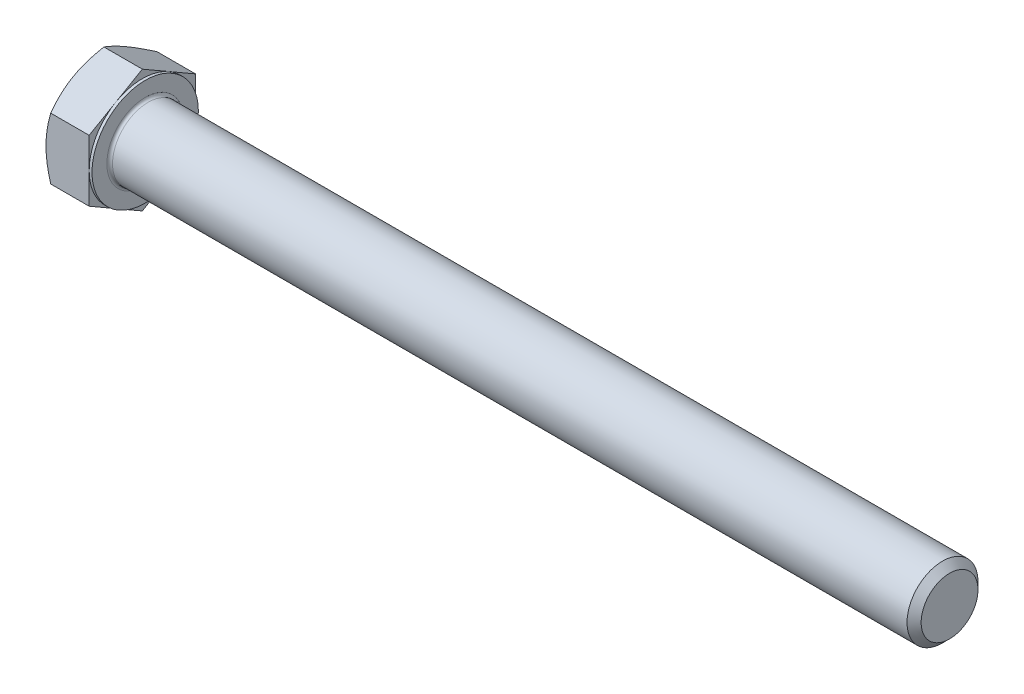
ISO-10303-21;
HEADER;
FILE_DESCRIPTION(('STEP AP214'),'2;1');
FILE_NAME('part.step','',(''),(''),'','','');
FILE_SCHEMA(('AUTOMOTIVE_DESIGN { 1 0 10303 214 1 1 1 1 }'));
ENDSEC;
DATA;
#1=APPLICATION_CONTEXT('core data for automotive mechanical design processes');
#2=APPLICATION_PROTOCOL_DEFINITION('international standard','automotive_design',2000,#1);
#3=PRODUCT_CONTEXT('',#1,'mechanical');
#4=PRODUCT('Part','Part','',(#3));
#5=PRODUCT_RELATED_PRODUCT_CATEGORY('part','',(#4));
#6=PRODUCT_DEFINITION_FORMATION('','',#4);
#7=PRODUCT_DEFINITION_CONTEXT('part definition',#1,'design');
#8=PRODUCT_DEFINITION('design','',#6,#7);
#9=PRODUCT_DEFINITION_SHAPE('','',#8);
#10=(LENGTH_UNIT() NAMED_UNIT(*) SI_UNIT(.MILLI.,.METRE.));
#11=(NAMED_UNIT(*) PLANE_ANGLE_UNIT() SI_UNIT($,.RADIAN.));
#12=(NAMED_UNIT(*) SI_UNIT($,.STERADIAN.) SOLID_ANGLE_UNIT());
#13=UNCERTAINTY_MEASURE_WITH_UNIT(LENGTH_MEASURE(1.E-05),#10,'distance_accuracy_value','');
#14=(GEOMETRIC_REPRESENTATION_CONTEXT(3) GLOBAL_UNCERTAINTY_ASSIGNED_CONTEXT((#13)) GLOBAL_UNIT_ASSIGNED_CONTEXT((#10,
#11,#12)) REPRESENTATION_CONTEXT('',''));
#15=CARTESIAN_POINT('',(0.,0.,0.));
#16=DIRECTION('',(0.,0.,1.));
#17=DIRECTION('',(1.,0.,0.));
#18=AXIS2_PLACEMENT_3D('',#15,#16,#17);
#19=CARTESIAN_POINT('',(6.5532,0.,0.));
#20=DIRECTION('',(1.,0.,0.));
#21=DIRECTION('',(0.,0.,-1.));
#22=AXIS2_PLACEMENT_3D('',#19,#20,#21);
#23=TOROIDAL_SURFACE('',#22,5.1435,0.381);
#24=CARTESIAN_POINT('',(6.5532,0.,0.));
#25=DIRECTION('',(1.,0.,0.));
#26=DIRECTION('',(0.,0.,-1.));
#27=AXIS2_PLACEMENT_3D('',#24,#25,#26);
#28=CIRCLE('',#27,4.7625);
#29=CARTESIAN_POINT('',(6.5532,0.,-4.7625));
#30=VERTEX_POINT('',#29);
#31=EDGE_CURVE('E28',#30,#30,#28,.T.);
#32=ORIENTED_EDGE('',*,*,#31,.F.);
#33=EDGE_LOOP('',(#32));
#34=FACE_BOUND('',#33,.T.);
#35=CARTESIAN_POINT('',(6.1722,0.,0.));
#36=DIRECTION('',(-1.,0.,0.));
#37=DIRECTION('',(0.,0.,-1.));
#38=AXIS2_PLACEMENT_3D('',#35,#36,#37);
#39=CIRCLE('',#38,5.1435);
#40=CARTESIAN_POINT('',(6.1722,0.,-5.1435));
#41=VERTEX_POINT('',#40);
#42=EDGE_CURVE('E236',#41,#41,#39,.T.);
#43=ORIENTED_EDGE('',*,*,#42,.F.);
#44=EDGE_LOOP('',(#43));
#45=FACE_BOUND('',#44,.T.);
#46=ADVANCED_FACE('F17',(#34,#45),#23,.F.);
#47=CARTESIAN_POINT('',(0.,0.,0.));
#48=DIRECTION('',(-1.,0.,0.));
#49=DIRECTION('',(0.,0.,1.));
#50=AXIS2_PLACEMENT_3D('',#47,#48,#49);
#51=CYLINDRICAL_SURFACE('',#50,7.1374);
#52=CARTESIAN_POINT('',(6.1722,0.,0.));
#53=DIRECTION('',(1.,0.,0.));
#54=DIRECTION('',(0.,0.,-1.));
#55=AXIS2_PLACEMENT_3D('',#52,#53,#54);
#56=CIRCLE('',#55,7.1374);
#57=CARTESIAN_POINT('',(6.1722,0.,-7.1374));
#58=VERTEX_POINT('',#57);
#59=EDGE_CURVE('E238',#58,#58,#56,.T.);
#60=ORIENTED_EDGE('',*,*,#59,.F.);
#61=EDGE_LOOP('',(#60));
#62=FACE_BOUND('',#61,.T.);
#63=CARTESIAN_POINT('',(5.7912,0.,0.));
#64=DIRECTION('',(-1.,0.,0.));
#65=DIRECTION('',(0.,0.,1.));
#66=AXIS2_PLACEMENT_3D('',#63,#64,#65);
#67=CIRCLE('',#66,7.1374);
#68=CARTESIAN_POINT('',(5.7912,0.,-7.1374));
#69=VERTEX_POINT('',#68);
#70=CARTESIAN_POINT('',(5.7912,-6.18116971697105,-3.5687));
#71=VERTEX_POINT('',#70);
#72=EDGE_CURVE('E221',#69,#71,#67,.T.);
#73=ORIENTED_EDGE('',*,*,#72,.F.);
#74=CARTESIAN_POINT('',(5.7912,0.,0.));
#75=DIRECTION('',(-1.,0.,0.));
#76=DIRECTION('',(0.,0.,1.));
#77=AXIS2_PLACEMENT_3D('',#74,#75,#76);
#78=CIRCLE('',#77,7.1374);
#79=CARTESIAN_POINT('',(5.7912,6.18116971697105,-3.5687));
#80=VERTEX_POINT('',#79);
#81=EDGE_CURVE('E233',#80,#69,#78,.T.);
#82=ORIENTED_EDGE('',*,*,#81,.F.);
#83=CARTESIAN_POINT('',(5.7912,0.,0.));
#84=DIRECTION('',(-1.,0.,0.));
#85=DIRECTION('',(0.,0.,1.));
#86=AXIS2_PLACEMENT_3D('',#83,#84,#85);
#87=CIRCLE('',#86,7.1374);
#88=CARTESIAN_POINT('',(5.7912,6.18116971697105,3.5687));
#89=VERTEX_POINT('',#88);
#90=EDGE_CURVE('E161',#89,#80,#87,.T.);
#91=ORIENTED_EDGE('',*,*,#90,.F.);
#92=CARTESIAN_POINT('',(5.7912,0.,0.));
#93=DIRECTION('',(-1.,0.,0.));
#94=DIRECTION('',(0.,0.,1.));
#95=AXIS2_PLACEMENT_3D('',#92,#93,#94);
#96=CIRCLE('',#95,7.1374);
#97=CARTESIAN_POINT('',(5.7912,0.,7.1374));
#98=VERTEX_POINT('',#97);
#99=EDGE_CURVE('E154',#98,#89,#96,.T.);
#100=ORIENTED_EDGE('',*,*,#99,.F.);
#101=CARTESIAN_POINT('',(5.7912,0.,0.));
#102=DIRECTION('',(-1.,0.,0.));
#103=DIRECTION('',(0.,0.,1.));
#104=AXIS2_PLACEMENT_3D('',#101,#102,#103);
#105=CIRCLE('',#104,7.1374);
#106=CARTESIAN_POINT('',(5.7912,-6.18116971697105,3.5687));
#107=VERTEX_POINT('',#106);
#108=EDGE_CURVE('E158',#107,#98,#105,.T.);
#109=ORIENTED_EDGE('',*,*,#108,.F.);
#110=CARTESIAN_POINT('',(5.7912,0.,0.));
#111=DIRECTION('',(-1.,0.,0.));
#112=DIRECTION('',(0.,0.,1.));
#113=AXIS2_PLACEMENT_3D('',#110,#111,#112);
#114=CIRCLE('',#113,7.1374);
#115=EDGE_CURVE('E177',#71,#107,#114,.T.);
#116=ORIENTED_EDGE('',*,*,#115,.F.);
#117=EDGE_LOOP('',(#73,#82,#91,#100,#109,#116));
#118=FACE_BOUND('',#117,.T.);
#119=ADVANCED_FACE('F157',(#62,#118),#51,.T.);
#120=CARTESIAN_POINT('',(114.1222,0.,0.));
#121=DIRECTION('',(-1.,0.,0.));
#122=DIRECTION('',(0.,0.,1.));
#123=AXIS2_PLACEMENT_3D('',#120,#121,#122);
#124=CONICAL_SURFACE('',#123,3.81635,0.785398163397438);
#125=CARTESIAN_POINT('',(114.1222,0.,0.));
#126=DIRECTION('',(-1.,0.,0.));
#127=DIRECTION('',(0.,0.,1.));
#128=AXIS2_PLACEMENT_3D('',#125,#126,#127);
#129=CIRCLE('',#128,3.81635);
#130=CARTESIAN_POINT('',(114.1222,0.,3.81635));
#131=VERTEX_POINT('',#130);
#132=EDGE_CURVE('E242',#131,#131,#129,.T.);
#133=ORIENTED_EDGE('',*,*,#132,.T.);
#134=EDGE_LOOP('',(#133));
#135=FACE_BOUND('',#134,.T.);
#136=CARTESIAN_POINT('',(113.17605,0.,0.));
#137=DIRECTION('',(-1.,0.,0.));
#138=DIRECTION('',(0.,0.,1.));
#139=AXIS2_PLACEMENT_3D('',#136,#137,#138);
#140=CIRCLE('',#139,4.7625);
#141=CARTESIAN_POINT('',(113.17605,0.,4.7625));
#142=VERTEX_POINT('',#141);
#143=EDGE_CURVE('E11',#142,#142,#140,.T.);
#144=ORIENTED_EDGE('',*,*,#143,.F.);
#145=EDGE_LOOP('',(#144));
#146=FACE_BOUND('',#145,.T.);
#147=ADVANCED_FACE('F577',(#135,#146),#124,.T.);
#148=CARTESIAN_POINT('',(0.,0.,0.));
#149=DIRECTION('',(-1.,0.,0.));
#150=DIRECTION('',(0.,0.,1.));
#151=AXIS2_PLACEMENT_3D('',#148,#149,#150);
#152=CYLINDRICAL_SURFACE('',#151,4.7625);
#153=ORIENTED_EDGE('',*,*,#143,.T.);
#154=EDGE_LOOP('',(#153));
#155=FACE_BOUND('',#154,.T.);
#156=ORIENTED_EDGE('',*,*,#31,.T.);
#157=EDGE_LOOP('',(#156));
#158=FACE_BOUND('',#157,.T.);
#159=ADVANCED_FACE('F586',(#155,#158),#152,.T.);
#160=CARTESIAN_POINT('',(6.1722,8.24155962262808,0.));
#161=DIRECTION('',(1.,0.,0.));
#162=DIRECTION('',(0.,1.,0.));
#163=AXIS2_PLACEMENT_3D('',#160,#161,#162);
#164=PLANE('',#163);
#165=ORIENTED_EDGE('',*,*,#42,.T.);
#166=EDGE_LOOP('',(#165));
#167=FACE_BOUND('',#166,.T.);
#168=ORIENTED_EDGE('',*,*,#59,.T.);
#169=EDGE_LOOP('',(#168));
#170=FACE_BOUND('',#169,.T.);
#171=ADVANCED_FACE('F582',(#167,#170),#164,.T.);
#172=CARTESIAN_POINT('',(114.1222,0.,0.));
#173=DIRECTION('',(-1.,0.,0.));
#174=DIRECTION('',(0.,0.,1.));
#175=AXIS2_PLACEMENT_3D('',#172,#173,#174);
#176=PLANE('',#175);
#177=ORIENTED_EDGE('',*,*,#132,.F.);
#178=EDGE_LOOP('',(#177));
#179=FACE_BOUND('',#178,.T.);
#180=ADVANCED_FACE('F585',(#179),#176,.F.);
#181=CARTESIAN_POINT('',(5.7912,7.1374,0.));
#182=DIRECTION('',(1.,0.,0.));
#183=DIRECTION('',(0.,1.,0.));
#184=AXIS2_PLACEMENT_3D('',#181,#182,#183);
#185=PLANE('',#184);
#186=DIRECTION('',(0.,0.5,0.866025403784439));
#187=VECTOR('',#186,1.);
#188=CARTESIAN_POINT('',(5.7912,4.12077981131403,-7.1374));
#189=LINE('',#188,#187);
#190=CARTESIAN_POINT('',(5.7912,4.12077981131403,-7.1374));
#191=VERTEX_POINT('',#190);
#192=EDGE_CURVE('E305',#191,#80,#189,.T.);
#193=ORIENTED_EDGE('',*,*,#192,.T.);
#194=ORIENTED_EDGE('',*,*,#81,.T.);
#195=DIRECTION('',(0.,1.,0.));
#196=VECTOR('',#195,1.);
#197=CARTESIAN_POINT('',(5.7912,4.12077981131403,-7.1374));
#198=LINE('',#197,#196);
#199=EDGE_CURVE('E226',#69,#191,#198,.T.);
#200=ORIENTED_EDGE('',*,*,#199,.T.);
#201=EDGE_LOOP('',(#193,#194,#200));
#202=FACE_BOUND('',#201,.T.);
#203=ADVANCED_FACE('F691',(#202),#185,.T.);
#204=CARTESIAN_POINT('',(5.7912,7.1374,0.));
#205=DIRECTION('',(1.,0.,0.));
#206=DIRECTION('',(0.,1.,0.));
#207=AXIS2_PLACEMENT_3D('',#204,#205,#206);
#208=PLANE('',#207);
#209=DIRECTION('',(0.,0.5,0.866025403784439));
#210=VECTOR('',#209,1.);
#211=CARTESIAN_POINT('',(5.7912,4.12077981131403,-7.1374));
#212=LINE('',#211,#210);
#213=CARTESIAN_POINT('',(5.7912,8.24155962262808,0.));
#214=VERTEX_POINT('',#213);
#215=EDGE_CURVE('E545',#80,#214,#212,.T.);
#216=ORIENTED_EDGE('',*,*,#215,.T.);
#217=DIRECTION('',(0.,-0.5,0.866025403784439));
#218=VECTOR('',#217,1.);
#219=CARTESIAN_POINT('',(5.7912,8.24155962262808,0.));
#220=LINE('',#219,#218);
#221=EDGE_CURVE('E595',#214,#89,#220,.T.);
#222=ORIENTED_EDGE('',*,*,#221,.T.);
#223=ORIENTED_EDGE('',*,*,#90,.T.);
#224=EDGE_LOOP('',(#216,#222,#223));
#225=FACE_BOUND('',#224,.T.);
#226=ADVANCED_FACE('F688',(#225),#208,.T.);
#227=CARTESIAN_POINT('',(5.7912,7.1374,0.));
#228=DIRECTION('',(1.,0.,0.));
#229=DIRECTION('',(0.,1.,0.));
#230=AXIS2_PLACEMENT_3D('',#227,#228,#229);
#231=PLANE('',#230);
#232=DIRECTION('',(0.,-0.5,0.866025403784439));
#233=VECTOR('',#232,1.);
#234=CARTESIAN_POINT('',(5.7912,8.24155962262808,0.));
#235=LINE('',#234,#233);
#236=CARTESIAN_POINT('',(5.7912,4.12077981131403,7.1374));
#237=VERTEX_POINT('',#236);
#238=EDGE_CURVE('E189',#89,#237,#235,.T.);
#239=ORIENTED_EDGE('',*,*,#238,.T.);
#240=DIRECTION('',(0.,-1.,0.));
#241=VECTOR('',#240,1.);
#242=CARTESIAN_POINT('',(5.7912,4.12077981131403,7.1374));
#243=LINE('',#242,#241);
#244=EDGE_CURVE('E182',#237,#98,#243,.T.);
#245=ORIENTED_EDGE('',*,*,#244,.T.);
#246=ORIENTED_EDGE('',*,*,#99,.T.);
#247=EDGE_LOOP('',(#239,#245,#246));
#248=FACE_BOUND('',#247,.T.);
#249=ADVANCED_FACE('F188',(#248),#231,.T.);
#250=CARTESIAN_POINT('',(5.7912,7.1374,0.));
#251=DIRECTION('',(1.,0.,0.));
#252=DIRECTION('',(0.,1.,0.));
#253=AXIS2_PLACEMENT_3D('',#250,#251,#252);
#254=PLANE('',#253);
#255=DIRECTION('',(0.,-1.,0.));
#256=VECTOR('',#255,1.);
#257=CARTESIAN_POINT('',(5.7912,4.12077981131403,7.1374));
#258=LINE('',#257,#256);
#259=CARTESIAN_POINT('',(5.7912,-4.12077981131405,7.1374));
#260=VERTEX_POINT('',#259);
#261=EDGE_CURVE('E173',#98,#260,#258,.T.);
#262=ORIENTED_EDGE('',*,*,#261,.T.);
#263=DIRECTION('',(0.,-0.5,-0.866025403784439));
#264=VECTOR('',#263,1.);
#265=CARTESIAN_POINT('',(5.7912,-8.2415596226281,0.));
#266=LINE('',#265,#264);
#267=EDGE_CURVE('E175',#260,#107,#266,.T.);
#268=ORIENTED_EDGE('',*,*,#267,.T.);
#269=ORIENTED_EDGE('',*,*,#108,.T.);
#270=EDGE_LOOP('',(#262,#268,#269));
#271=FACE_BOUND('',#270,.T.);
#272=ADVANCED_FACE('F172',(#271),#254,.T.);
#273=CARTESIAN_POINT('',(5.7912,7.1374,0.));
#274=DIRECTION('',(1.,0.,0.));
#275=DIRECTION('',(0.,1.,0.));
#276=AXIS2_PLACEMENT_3D('',#273,#274,#275);
#277=PLANE('',#276);
#278=DIRECTION('',(0.,-0.5,-0.866025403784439));
#279=VECTOR('',#278,1.);
#280=CARTESIAN_POINT('',(5.7912,-8.2415596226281,0.));
#281=LINE('',#280,#279);
#282=CARTESIAN_POINT('',(5.7912,-8.2415596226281,0.));
#283=VERTEX_POINT('',#282);
#284=EDGE_CURVE('E205',#107,#283,#281,.T.);
#285=ORIENTED_EDGE('',*,*,#284,.T.);
#286=DIRECTION('',(0.,0.5,-0.866025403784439));
#287=VECTOR('',#286,1.);
#288=CARTESIAN_POINT('',(5.7912,-4.12077981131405,-7.1374));
#289=LINE('',#288,#287);
#290=EDGE_CURVE('E209',#283,#71,#289,.T.);
#291=ORIENTED_EDGE('',*,*,#290,.T.);
#292=ORIENTED_EDGE('',*,*,#115,.T.);
#293=EDGE_LOOP('',(#285,#291,#292));
#294=FACE_BOUND('',#293,.T.);
#295=ADVANCED_FACE('F437',(#294),#277,.T.);
#296=CARTESIAN_POINT('',(5.7912,7.1374,0.));
#297=DIRECTION('',(1.,0.,0.));
#298=DIRECTION('',(0.,1.,0.));
#299=AXIS2_PLACEMENT_3D('',#296,#297,#298);
#300=PLANE('',#299);
#301=DIRECTION('',(0.,0.5,-0.866025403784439));
#302=VECTOR('',#301,1.);
#303=CARTESIAN_POINT('',(5.7912,-4.12077981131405,-7.1374));
#304=LINE('',#303,#302);
#305=CARTESIAN_POINT('',(5.7912,-4.12077981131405,-7.1374));
#306=VERTEX_POINT('',#305);
#307=EDGE_CURVE('E220',#71,#306,#304,.T.);
#308=ORIENTED_EDGE('',*,*,#307,.T.);
#309=DIRECTION('',(0.,1.,0.));
#310=VECTOR('',#309,1.);
#311=CARTESIAN_POINT('',(5.7912,4.12077981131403,-7.1374));
#312=LINE('',#311,#310);
#313=EDGE_CURVE('E215',#306,#69,#312,.T.);
#314=ORIENTED_EDGE('',*,*,#313,.T.);
#315=ORIENTED_EDGE('',*,*,#72,.T.);
#316=EDGE_LOOP('',(#308,#314,#315));
#317=FACE_BOUND('',#316,.T.);
#318=ADVANCED_FACE('F633',(#317),#300,.T.);
#319=CARTESIAN_POINT('',(0.,8.24155962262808,0.));
#320=DIRECTION('',(1.,0.,0.));
#321=DIRECTION('',(0.,1.,0.));
#322=AXIS2_PLACEMENT_3D('',#319,#320,#321);
#323=PLANE('',#322);
#324=CARTESIAN_POINT('',(0.,0.,0.));
#325=DIRECTION('',(1.,0.,0.));
#326=DIRECTION('',(0.,0.,-1.));
#327=AXIS2_PLACEMENT_3D('',#324,#325,#326);
#328=CIRCLE('',#327,7.1374);
#329=CARTESIAN_POINT('',(0.,0.,-7.1374));
#330=VERTEX_POINT('',#329);
#331=CARTESIAN_POINT('',(0.,6.18116971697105,-3.5687));
#332=VERTEX_POINT('',#331);
#333=EDGE_CURVE('E318',#330,#332,#328,.T.);
#334=ORIENTED_EDGE('',*,*,#333,.F.);
#335=CARTESIAN_POINT('',(0.,0.,0.));
#336=DIRECTION('',(1.,0.,0.));
#337=DIRECTION('',(0.,0.,-1.));
#338=AXIS2_PLACEMENT_3D('',#335,#336,#337);
#339=CIRCLE('',#338,7.1374);
#340=CARTESIAN_POINT('',(0.,-6.18116971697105,-3.5687));
#341=VERTEX_POINT('',#340);
#342=EDGE_CURVE('E229',#341,#330,#339,.T.);
#343=ORIENTED_EDGE('',*,*,#342,.F.);
#344=CARTESIAN_POINT('',(0.,0.,0.));
#345=DIRECTION('',(1.,0.,0.));
#346=DIRECTION('',(0.,0.,-1.));
#347=AXIS2_PLACEMENT_3D('',#344,#345,#346);
#348=CIRCLE('',#347,7.1374);
#349=CARTESIAN_POINT('',(0.,-6.18116971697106,3.5687));
#350=VERTEX_POINT('',#349);
#351=EDGE_CURVE('E321',#350,#341,#348,.T.);
#352=ORIENTED_EDGE('',*,*,#351,.F.);
#353=CARTESIAN_POINT('',(0.,0.,0.));
#354=DIRECTION('',(1.,0.,0.));
#355=DIRECTION('',(0.,0.,-1.));
#356=AXIS2_PLACEMENT_3D('',#353,#354,#355);
#357=CIRCLE('',#356,7.1374);
#358=CARTESIAN_POINT('',(0.,0.,7.1374));
#359=VERTEX_POINT('',#358);
#360=EDGE_CURVE('E379',#359,#350,#357,.T.);
#361=ORIENTED_EDGE('',*,*,#360,.F.);
#362=CARTESIAN_POINT('',(0.,0.,0.));
#363=DIRECTION('',(-1.,0.,0.));
#364=DIRECTION('',(0.,0.,1.));
#365=AXIS2_PLACEMENT_3D('',#362,#363,#364);
#366=CIRCLE('',#365,7.1374);
#367=CARTESIAN_POINT('',(0.,6.18116971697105,3.5687));
#368=VERTEX_POINT('',#367);
#369=EDGE_CURVE('E469',#359,#368,#366,.T.);
#370=ORIENTED_EDGE('',*,*,#369,.T.);
#371=CARTESIAN_POINT('',(0.,0.,0.));
#372=DIRECTION('',(1.,0.,0.));
#373=DIRECTION('',(0.,0.,-1.));
#374=AXIS2_PLACEMENT_3D('',#371,#372,#373);
#375=CIRCLE('',#374,7.1374);
#376=EDGE_CURVE('E225',#332,#368,#375,.T.);
#377=ORIENTED_EDGE('',*,*,#376,.F.);
#378=EDGE_LOOP('',(#334,#343,#352,#361,#370,#377));
#379=FACE_BOUND('',#378,.T.);
#380=ADVANCED_FACE('F666',(#379),#323,.F.);
#381=CARTESIAN_POINT('',(0.,0.,0.));
#382=DIRECTION('',(1.,0.,0.));
#383=DIRECTION('',(0.,0.,-1.));
#384=AXIS2_PLACEMENT_3D('',#381,#382,#383);
#385=CONICAL_SURFACE('',#384,7.1374,1.0471975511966);
#386=CARTESIAN_POINT('',(0.,6.18116971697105,3.56869999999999));
#387=CARTESIAN_POINT('',(-6.04948282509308E-05,6.26773818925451,3.41865084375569));
#388=CARTESIAN_POINT('',(0.00354461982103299,6.35425597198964,3.26857482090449));
#389=CARTESIAN_POINT('',(0.0179524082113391,6.52690535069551,2.96921326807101));
#390=CARTESIAN_POINT('',(0.0287310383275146,6.61303727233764,2.81992677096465));
#391=CARTESIAN_POINT('',(0.0574742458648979,6.78593479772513,2.52072446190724));
#392=CARTESIAN_POINT('',(0.0754987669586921,6.87269960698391,2.37081398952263));
#393=CARTESIAN_POINT('',(0.118606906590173,7.0474776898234,2.06878301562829));
#394=CARTESIAN_POINT('',(0.143821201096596,7.13548235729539,1.91667635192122));
#395=CARTESIAN_POINT('',(0.19926242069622,7.30684815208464,1.61991009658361));
#396=CARTESIAN_POINT('',(0.22921829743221,7.39024249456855,1.47521869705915));
#397=CARTESIAN_POINT('',(0.295004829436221,7.55771341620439,1.18475513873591));
#398=CARTESIAN_POINT('',(0.330912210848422,7.64178308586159,1.038996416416));
#399=CARTESIAN_POINT('',(0.408543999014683,7.81108886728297,0.745574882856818));
#400=CARTESIAN_POINT('',(0.450371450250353,7.89631413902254,0.597933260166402));
#401=CARTESIAN_POINT('',(0.539828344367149,8.06833085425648,0.299991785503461));
#402=CARTESIAN_POINT('',(0.587577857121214,8.1551073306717,0.149719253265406));
#403=CARTESIAN_POINT('',(0.637486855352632,8.24155962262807,0.));
#404=B_SPLINE_CURVE_WITH_KNOTS('',3,(#386,#387,#388,#389,#390,#391,#392,#393,#394,#395,#396,
#397,#398,#399,#400,#401,#402,#403),.UNSPECIFIED.,.F.,.F.,(4,2,2,2,2,2,2,2,4),(0.,
0.519648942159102,1.0375648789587,1.55985661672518,2.09232296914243,2.60123736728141,
3.1173120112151,3.64383408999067,4.18368472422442),.UNSPECIFIED.);
#405=CARTESIAN_POINT('',(0.637486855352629,8.24155962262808,0.));
#406=VERTEX_POINT('',#405);
#407=EDGE_CURVE('E524',#368,#406,#404,.T.);
#408=ORIENTED_EDGE('',*,*,#407,.T.);
#409=CARTESIAN_POINT('',(0.637486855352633,8.24155962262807,0.));
#410=CARTESIAN_POINT('',(0.587583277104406,8.15511676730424,-0.149703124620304));
#411=CARTESIAN_POINT('',(0.539839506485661,8.06835106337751,-0.299960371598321));
#412=CARTESIAN_POINT('',(0.450390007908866,7.89635008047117,-0.59788296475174));
#413=CARTESIAN_POINT('',(0.408564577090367,7.81112970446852,-0.745521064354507));
#414=CARTESIAN_POINT('',(0.330933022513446,7.64182652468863,-1.0389453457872));
#415=CARTESIAN_POINT('',(0.295024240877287,7.55775454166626,-1.18471043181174));
#416=CARTESIAN_POINT('',(0.229229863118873,7.39026838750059,-1.47519302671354));
#417=CARTESIAN_POINT('',(0.199267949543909,7.30686116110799,-1.61989721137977));
#418=CARTESIAN_POINT('',(0.143821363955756,7.13548712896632,-1.91665800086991));
#419=CARTESIAN_POINT('',(0.118606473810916,7.04748725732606,-2.06874626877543));
#420=CARTESIAN_POINT('',(0.0754977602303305,6.87271818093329,-2.37075428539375));
#421=CARTESIAN_POINT('',(0.0574736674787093,6.78595745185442,-2.52066017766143));
#422=CARTESIAN_POINT('',(0.0287306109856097,6.61306320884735,-2.81986443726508));
#423=CARTESIAN_POINT('',(0.0179521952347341,6.52693047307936,-2.96915750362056));
#424=CARTESIAN_POINT('',(0.00354432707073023,6.35427263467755,-3.26854229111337));
#425=CARTESIAN_POINT('',(-6.05748548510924E-05,6.26774719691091,-3.41863499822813));
#426=CARTESIAN_POINT('',(0.,6.18116971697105,-3.5687));
#427=B_SPLINE_CURVE_WITH_KNOTS('',3,(#409,#410,#411,#412,#413,#414,#415,#416,#417,#418,#419,
#420,#421,#422,#423,#424,#425,#426),.UNSPECIFIED.,.F.,.F.,(4,2,2,2,2,2,2,2,4),(0.,
0.539792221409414,1.06629682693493,1.58239198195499,2.09136133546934,2.62377348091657,
3.14604706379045,3.66398121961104,4.18368491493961),.UNSPECIFIED.);
#428=EDGE_CURVE('E294',#406,#332,#427,.T.);
#429=ORIENTED_EDGE('',*,*,#428,.T.);
#430=ORIENTED_EDGE('',*,*,#376,.T.);
#431=EDGE_LOOP('',(#408,#429,#430));
#432=FACE_BOUND('',#431,.T.);
#433=ADVANCED_FACE('F271',(#432),#385,.T.);
#434=CARTESIAN_POINT('',(0.,0.,0.));
#435=DIRECTION('',(1.,0.,0.));
#436=DIRECTION('',(0.,0.,-1.));
#437=AXIS2_PLACEMENT_3D('',#434,#435,#436);
#438=CONICAL_SURFACE('',#437,7.1374,1.0471975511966);
#439=CARTESIAN_POINT('',(0.,0.,7.1374));
#440=CARTESIAN_POINT('',(-6.04948282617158E-05,0.173230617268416,7.13734591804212));
#441=CARTESIAN_POINT('',(0.00354461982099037,0.346459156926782,7.13723450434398));
#442=CARTESIAN_POINT('',(0.0179524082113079,0.692038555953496,7.13707247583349));
#443=CARTESIAN_POINT('',(0.0287310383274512,0.864390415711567,7.13702165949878));
#444=CARTESIAN_POINT('',(0.0574742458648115,1.20995597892,7.13715415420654));
#445=CARTESIAN_POINT('',(0.0754987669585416,1.3831646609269,7.13733944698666));
#446=CARTESIAN_POINT('',(0.118606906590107,1.73212019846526,7.13768621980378));
#447=CARTESIAN_POINT('',(0.143821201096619,1.90785076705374,7.13784716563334));
#448=CARTESIAN_POINT('',(0.19926242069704,2.25054078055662,7.1378711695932));
#449=CARTESIAN_POINT('',(0.229218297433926,2.41754437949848,7.13774708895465));
#450=CARTESIAN_POINT('',(0.295004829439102,2.75282866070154,7.13754938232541));
#451=CARTESIAN_POINT('',(0.330912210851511,2.92109425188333,7.13747649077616));
#452=CARTESIAN_POINT('',(0.408543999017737,3.25985764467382,7.13738883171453));
#453=CARTESIAN_POINT('',(0.450371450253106,3.43033167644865,7.13737527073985));
#454=CARTESIAN_POINT('',(0.539828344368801,3.77436491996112,7.13737537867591));
#455=CARTESIAN_POINT('',(0.587577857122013,3.94789298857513,7.13738974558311));
#456=CARTESIAN_POINT('',(0.637486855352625,4.12077981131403,7.13739999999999));
#457=B_SPLINE_CURVE_WITH_KNOTS('',3,(#439,#440,#441,#442,#443,#444,#445,#446,#447,#448,#449,
#450,#451,#452,#453,#454,#455,#456),.UNSPECIFIED.,.F.,.F.,(4,2,2,2,2,2,2,2,4),(0.,
0.519648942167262,1.03756487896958,1.55985661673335,2.09232296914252,2.60123736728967,
3.11731201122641,3.64383408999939,4.18368472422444),.UNSPECIFIED.);
#458=CARTESIAN_POINT('',(0.637486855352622,4.12077981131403,7.1374));
#459=VERTEX_POINT('',#458);
#460=EDGE_CURVE('E192',#359,#459,#457,.T.);
#461=ORIENTED_EDGE('',*,*,#460,.T.);
#462=CARTESIAN_POINT('',(0.637486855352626,4.12077981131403,7.1374));
#463=CARTESIAN_POINT('',(0.587583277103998,4.20720509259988,6.98768672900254));
#464=CARTESIAN_POINT('',(0.539839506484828,4.29394883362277,6.83741680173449));
#465=CARTESIAN_POINT('',(0.450390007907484,4.46595687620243,6.53949828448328));
#466=CARTESIAN_POINT('',(0.408564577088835,4.5512050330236,6.3918762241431));
#467=CARTESIAN_POINT('',(0.330933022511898,4.7206663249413,6.09854322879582));
#468=CARTESIAN_POINT('',(0.295024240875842,4.80486660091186,5.95285221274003));
#469=CARTESIAN_POINT('',(0.22922986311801,4.97268883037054,5.66256365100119));
#470=CARTESIAN_POINT('',(0.199267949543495,5.05630271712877,5.51797878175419));
#471=CARTESIAN_POINT('',(0.14382136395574,5.22761808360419,5.22118412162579));
#472=CARTESIAN_POINT('',(0.118606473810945,5.31533045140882,5.06892986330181));
#473=CARTESIAN_POINT('',(0.075497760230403,5.48949252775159,4.76657139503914));
#474=CARTESIAN_POINT('',(0.0574736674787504,5.57593447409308,4.6164814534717));
#475=CARTESIAN_POINT('',(0.0287306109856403,5.74860584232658,4.31714851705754));
#476=CARTESIAN_POINT('',(0.017952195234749,5.83483106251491,4.16790884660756));
#477=CARTESIAN_POINT('',(0.00354432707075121,6.00777697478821,3.86869037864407));
#478=CARTESIAN_POINT('',(-6.05748548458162E-05,6.09449835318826,3.71871079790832));
#479=CARTESIAN_POINT('',(0.,6.18116971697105,3.56869999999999));
#480=B_SPLINE_CURVE_WITH_KNOTS('',3,(#462,#463,#464,#465,#466,#467,#468,#469,#470,#471,#472,
#473,#474,#475,#476,#477,#478,#479),.UNSPECIFIED.,.F.,.F.,(4,2,2,2,2,2,2,2,4),(0.,
0.539792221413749,1.06629682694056,1.58239198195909,2.09136133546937,2.62377348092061,
3.14604706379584,3.66398121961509,4.18368491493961),.UNSPECIFIED.);
#481=EDGE_CURVE('E492',#459,#368,#480,.T.);
#482=ORIENTED_EDGE('',*,*,#481,.T.);
#483=ORIENTED_EDGE('',*,*,#369,.F.);
#484=EDGE_LOOP('',(#461,#482,#483));
#485=FACE_BOUND('',#484,.T.);
#486=ADVANCED_FACE('F398',(#485),#438,.T.);
#487=CARTESIAN_POINT('',(0.,0.,0.));
#488=DIRECTION('',(1.,0.,0.));
#489=DIRECTION('',(0.,0.,-1.));
#490=AXIS2_PLACEMENT_3D('',#487,#488,#489);
#491=CONICAL_SURFACE('',#490,7.1374,1.0471975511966);
#492=CARTESIAN_POINT('',(0.637486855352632,-4.12077981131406,7.13739999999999));
#493=CARTESIAN_POINT('',(0.587583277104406,-3.94791167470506,7.13738985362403));
#494=CARTESIAN_POINT('',(0.539839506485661,-3.77440222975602,7.13737717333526));
#495=CARTESIAN_POINT('',(0.450390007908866,-3.43039320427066,7.13738124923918));
#496=CARTESIAN_POINT('',(0.408564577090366,-3.25992467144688,7.13739728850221));
#497=CARTESIAN_POINT('',(0.330933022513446,-2.92116019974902,7.1374885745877));
#498=CARTESIAN_POINT('',(0.295024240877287,-2.75288794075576,7.13756264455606));
#499=CARTESIAN_POINT('',(0.229229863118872,-2.41757955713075,7.13775667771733));
#500=CARTESIAN_POINT('',(0.199267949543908,-2.25055844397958,7.13787599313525));
#501=CARTESIAN_POINT('',(0.143821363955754,-1.90786904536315,7.13784212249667));
#502=CARTESIAN_POINT('',(0.118606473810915,-1.73215680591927,7.1376761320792));
#503=CARTESIAN_POINT('',(0.0754977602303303,-1.38322565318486,7.13732568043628));
#504=CARTESIAN_POINT('',(0.0574736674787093,-1.21002297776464,7.13714163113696));
#505=CARTESIAN_POINT('',(0.0287306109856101,-0.864457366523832,7.13701295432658));
#506=CARTESIAN_POINT('',(0.0179521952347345,-0.692099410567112,7.13706635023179));
#507=CARTESIAN_POINT('',(0.00354432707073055,-0.346495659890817,7.13723266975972));
#508=CARTESIAN_POINT('',(-6.05748548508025E-05,-0.173248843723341,7.13734579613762));
#509=CARTESIAN_POINT('',(0.,0.,7.1374));
#510=B_SPLINE_CURVE_WITH_KNOTS('',3,(#492,#493,#494,#495,#496,#497,#498,#499,#500,#501,#502,
#503,#504,#505,#506,#507,#508,#509),.UNSPECIFIED.,.F.,.F.,(4,2,2,2,2,2,2,2,4),(0.,
0.539792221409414,1.06629682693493,1.58239198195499,2.09136133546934,2.62377348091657,
3.14604706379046,3.66398121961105,4.18368491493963),.UNSPECIFIED.);
#511=CARTESIAN_POINT('',(0.637486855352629,-4.12077981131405,7.1374));
#512=VERTEX_POINT('',#511);
#513=EDGE_CURVE('E197',#512,#359,#510,.T.);
#514=ORIENTED_EDGE('',*,*,#513,.T.);
#515=ORIENTED_EDGE('',*,*,#360,.T.);
#516=CARTESIAN_POINT('',(0.,-6.18116971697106,3.56870000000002));
#517=CARTESIAN_POINT('',(-6.04948282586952E-05,-6.09450757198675,3.71869507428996));
#518=CARTESIAN_POINT('',(0.00354461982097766,-6.00779681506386,3.86865968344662));
#519=CARTESIAN_POINT('',(0.0179524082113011,-5.83486679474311,4.16785920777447));
#520=CARTESIAN_POINT('',(0.0287310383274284,-5.74864685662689,4.31709488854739));
#521=CARTESIAN_POINT('',(0.0574742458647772,-5.57597881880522,4.61642969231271));
#522=CARTESIAN_POINT('',(0.0754987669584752,-5.48953494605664,4.76652545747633));
#523=CARTESIAN_POINT('',(0.118606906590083,-5.31535749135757,5.06890320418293));
#524=CARTESIAN_POINT('',(0.143821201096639,-5.22763159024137,5.22117081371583));
#525=CARTESIAN_POINT('',(0.199262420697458,-5.05630737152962,5.51796107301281));
#526=CARTESIAN_POINT('',(0.229218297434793,-4.97269811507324,5.66252839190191));
#527=CARTESIAN_POINT('',(0.295004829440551,-4.80488475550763,5.95279424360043));
#528=CARTESIAN_POINT('',(0.330912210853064,-4.72068883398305,6.09848007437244));
#529=CARTESIAN_POINT('',(0.408543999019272,-4.55123122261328,6.39181394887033));
#530=CARTESIAN_POINT('',(0.450371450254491,-4.46598246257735,6.5394420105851));
#531=CARTESIAN_POINT('',(0.539828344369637,-4.2939659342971,6.83738359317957));
#532=CARTESIAN_POINT('',(0.587577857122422,-4.2072143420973,6.98767049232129));
#533=CARTESIAN_POINT('',(0.637486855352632,-4.12077981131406,7.13739999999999));
#534=B_SPLINE_CURVE_WITH_KNOTS('',3,(#516,#517,#518,#519,#520,#521,#522,#523,#524,#525,#526,
#527,#528,#529,#530,#531,#532,#533),.UNSPECIFIED.,.F.,.F.,(4,2,2,2,2,2,2,2,4),(0.,
0.519648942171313,1.03756487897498,1.55985661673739,2.09232296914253,2.60123736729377,
3.11731201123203,3.6438340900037,4.18368472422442),.UNSPECIFIED.);
#535=EDGE_CURVE('E204',#350,#512,#534,.T.);
#536=ORIENTED_EDGE('',*,*,#535,.T.);
#537=EDGE_LOOP('',(#514,#515,#536));
#538=FACE_BOUND('',#537,.T.);
#539=ADVANCED_FACE('F349',(#538),#491,.T.);
#540=CARTESIAN_POINT('',(0.,0.,0.));
#541=DIRECTION('',(1.,0.,0.));
#542=DIRECTION('',(0.,0.,-1.));
#543=AXIS2_PLACEMENT_3D('',#540,#541,#542);
#544=CONICAL_SURFACE('',#543,7.1374,1.0471975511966);
#545=CARTESIAN_POINT('',(0.637486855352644,-8.24155962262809,0.));
#546=CARTESIAN_POINT('',(0.58758327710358,-8.1551167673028,0.149703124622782));
#547=CARTESIAN_POINT('',(0.539839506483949,-8.06835106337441,0.29996037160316));
#548=CARTESIAN_POINT('',(0.450390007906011,-7.89635008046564,0.597882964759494));
#549=CARTESIAN_POINT('',(0.4085645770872,-7.81112970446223,0.745521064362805));
#550=CARTESIAN_POINT('',(0.330933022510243,-7.64182652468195,1.03894534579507));
#551=CARTESIAN_POINT('',(0.295024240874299,-7.55775454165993,1.18471043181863));
#552=CARTESIAN_POINT('',(0.229229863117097,-7.39026838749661,1.47519302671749));
#553=CARTESIAN_POINT('',(0.199267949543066,-7.306861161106,1.61989721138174));
#554=CARTESIAN_POINT('',(0.143821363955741,-7.13548712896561,1.91665800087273));
#555=CARTESIAN_POINT('',(0.118606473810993,-7.04748725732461,2.0687462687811));
#556=CARTESIAN_POINT('',(0.0754977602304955,-6.87271818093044,2.37075428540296));
#557=CARTESIAN_POINT('',(0.0574736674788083,-6.78595745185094,2.52066017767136));
#558=CARTESIAN_POINT('',(0.0287306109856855,-6.61306320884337,2.81986443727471));
#559=CARTESIAN_POINT('',(0.0179521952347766,-6.5269304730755,2.96915750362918));
#560=CARTESIAN_POINT('',(0.0035443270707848,-6.35427263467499,3.26854229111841));
#561=CARTESIAN_POINT('',(-6.05748548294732E-05,-6.26774719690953,3.41863499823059));
#562=CARTESIAN_POINT('',(0.,-6.18116971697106,3.56870000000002));
#563=B_SPLINE_CURVE_WITH_KNOTS('',3,(#545,#546,#547,#548,#549,#550,#551,#552,#553,#554,#555,
#556,#557,#558,#559,#560,#561,#562),.UNSPECIFIED.,.F.,.F.,(4,2,2,2,2,2,2,2,4),(0.,
0.539792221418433,1.06629682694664,1.58239198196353,2.09136133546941,2.623773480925,
3.1460470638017,3.66398121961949,4.18368491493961),.UNSPECIFIED.);
#564=CARTESIAN_POINT('',(0.637486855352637,-8.2415596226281,0.));
#565=VERTEX_POINT('',#564);
#566=EDGE_CURVE('E418',#565,#350,#563,.T.);
#567=ORIENTED_EDGE('',*,*,#566,.T.);
#568=ORIENTED_EDGE('',*,*,#351,.T.);
#569=CARTESIAN_POINT('',(0.,-6.18116971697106,-3.56870000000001));
#570=CARTESIAN_POINT('',(-6.04948282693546E-05,-6.26773818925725,-3.4186508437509));
#571=CARTESIAN_POINT('',(0.00354461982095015,-6.3542559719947,-3.26857482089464));
#572=CARTESIAN_POINT('',(0.0179524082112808,-6.52690535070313,-2.96921326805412));
#573=CARTESIAN_POINT('',(0.0287310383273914,-6.61303727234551,-2.81992677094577));
#574=CARTESIAN_POINT('',(0.0574742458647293,-6.78593479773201,-2.52072446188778));
#575=CARTESIAN_POINT('',(0.0754987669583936,-6.87269960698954,-2.37081398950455));
#576=CARTESIAN_POINT('',(0.11860690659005,-7.04747768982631,-2.06878301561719));
#577=CARTESIAN_POINT('',(0.143821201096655,-7.13548235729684,-1.9166763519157));
#578=CARTESIAN_POINT('',(0.199262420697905,-7.30684815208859,-1.61991009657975));
#579=CARTESIAN_POINT('',(0.229218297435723,-7.3902424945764,-1.47521869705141));
#580=CARTESIAN_POINT('',(0.295004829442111,-7.55771341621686,-1.18475513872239));
#581=CARTESIAN_POINT('',(0.330912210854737,-7.64178308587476,-1.03899641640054));
#582=CARTESIAN_POINT('',(0.408543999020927,-7.81108886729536,-0.745574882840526));
#583=CARTESIAN_POINT('',(0.450371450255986,-7.89631413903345,-0.597933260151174));
#584=CARTESIAN_POINT('',(0.539828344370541,-8.06833085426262,-0.299991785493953));
#585=CARTESIAN_POINT('',(0.587577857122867,-8.15510733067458,-0.14971925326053));
#586=CARTESIAN_POINT('',(0.637486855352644,-8.24155962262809,0.));
#587=B_SPLINE_CURVE_WITH_KNOTS('',3,(#569,#570,#571,#572,#573,#574,#575,#576,#577,#578,#579,
#580,#581,#582,#583,#584,#585,#586),.UNSPECIFIED.,.F.,.F.,(4,2,2,2,2,2,2,2,4),(0.,
0.519648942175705,1.03756487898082,1.55985661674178,2.09232296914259,2.60123736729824,
3.11731201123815,3.64383409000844,4.18368472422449),.UNSPECIFIED.);
#588=EDGE_CURVE('E214',#341,#565,#587,.T.);
#589=ORIENTED_EDGE('',*,*,#588,.T.);
#590=EDGE_LOOP('',(#567,#568,#589));
#591=FACE_BOUND('',#590,.T.);
#592=ADVANCED_FACE('F269',(#591),#544,.T.);
#593=CARTESIAN_POINT('',(0.,0.,0.));
#594=DIRECTION('',(1.,0.,0.));
#595=DIRECTION('',(0.,0.,-1.));
#596=AXIS2_PLACEMENT_3D('',#593,#594,#595);
#597=CONICAL_SURFACE('',#596,7.1374,1.0471975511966);
#598=CARTESIAN_POINT('',(0.,6.18116971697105,-3.5687));
#599=CARTESIAN_POINT('',(-6.04948220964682E-05,6.0945075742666,-3.71869507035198));
#600=CARTESIAN_POINT('',(0.0035446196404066,6.00779681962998,-3.86865967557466));
#601=CARTESIAN_POINT('',(0.0179524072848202,5.83486680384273,-4.16785919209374));
#602=CARTESIAN_POINT('',(0.0287310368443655,5.74864686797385,-4.31709486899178));
#603=CARTESIAN_POINT('',(0.0574742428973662,5.5759788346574,-4.61642966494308));
#604=CARTESIAN_POINT('',(0.0754987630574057,5.48953496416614,-4.76652542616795));
#605=CARTESIAN_POINT('',(0.118606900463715,5.31535751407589,-5.06890316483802));
#606=CARTESIAN_POINT('',(0.143821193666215,5.22763161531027,-5.22117077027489));
#607=CARTESIAN_POINT('',(0.199262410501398,5.05630740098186,-5.51796102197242));
#608=CARTESIAN_POINT('',(0.229218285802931,4.97269814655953,-5.66252833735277));
#609=CARTESIAN_POINT('',(0.29500481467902,4.80488479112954,-5.95279418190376));
#610=CARTESIAN_POINT('',(0.330912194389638,4.72068887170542,-6.09848000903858));
#611=CARTESIAN_POINT('',(0.408543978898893,4.55123126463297,-6.39181387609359));
#612=CARTESIAN_POINT('',(0.450371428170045,4.46598250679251,-6.53944193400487));
#613=CARTESIAN_POINT('',(0.539828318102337,4.29396598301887,-6.83738350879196));
#614=CARTESIAN_POINT('',(0.587577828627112,4.20721439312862,-6.9876704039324));
#615=CARTESIAN_POINT('',(0.63748682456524,4.12077986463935,-7.13739990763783));
#616=B_SPLINE_CURVE_WITH_KNOTS('',3,(#598,#599,#600,#601,#602,#603,#604,#605,#606,#607,#608,
#609,#610,#611,#612,#613,#614,#615),.UNSPECIFIED.,.F.,.F.,(4,2,2,2,2,2,2,2,4),(0.,
0.519648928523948,1.03756485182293,1.55985657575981,2.09232291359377,2.60123729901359,
3.11731192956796,3.64383399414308,4.18368461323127),.UNSPECIFIED.);
#617=CARTESIAN_POINT('',(0.637486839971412,4.12077975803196,-7.1374));
#618=VERTEX_POINT('',#617);
#619=EDGE_CURVE('E289',#332,#618,#616,.T.);
#620=ORIENTED_EDGE('',*,*,#619,.T.);
#621=CARTESIAN_POINT('',(0.637486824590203,4.12077970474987,-7.1374));
#622=CARTESIAN_POINT('',(0.587583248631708,3.94791157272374,-7.13738985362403));
#623=CARTESIAN_POINT('',(0.539839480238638,3.77440213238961,-7.1373771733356));
#624=CARTESIAN_POINT('',(0.450389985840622,3.43039311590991,-7.13738124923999));
#625=CARTESIAN_POINT('',(0.408564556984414,3.25992458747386,-7.13739728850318));
#626=CARTESIAN_POINT('',(0.330933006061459,2.92116012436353,-7.13748857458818));
#627=CARTESIAN_POINT('',(0.295024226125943,2.75288786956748,-7.13756264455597));
#628=CARTESIAN_POINT('',(0.22922985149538,2.41757949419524,-7.13775667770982));
#629=CARTESIAN_POINT('',(0.199267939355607,2.2505583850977,-7.13787599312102));
#630=CARTESIAN_POINT('',(0.143821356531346,1.90786899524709,-7.13784212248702));
#631=CARTESIAN_POINT('',(0.118606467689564,1.73215676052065,-7.13767613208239));
#632=CARTESIAN_POINT('',(0.0754977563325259,1.38322561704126,-7.1373256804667));
#633=CARTESIAN_POINT('',(0.0574736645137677,1.21002294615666,-7.13714163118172));
#634=CARTESIAN_POINT('',(0.0287306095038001,0.864457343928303,-7.13701295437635));
#635=CARTESIAN_POINT('',(0.0179521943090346,0.692099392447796,-7.1370663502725));
#636=CARTESIAN_POINT('',(0.00354432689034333,0.34649565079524,-7.13723266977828));
#637=CARTESIAN_POINT('',(-6.05748486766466E-05,0.173248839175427,-7.13734579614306));
#638=CARTESIAN_POINT('',(0.,0.,-7.1374));
#639=B_SPLINE_CURVE_WITH_KNOTS('',3,(#621,#622,#623,#624,#625,#626,#627,#628,#629,#630,#631,
#632,#633,#634,#635,#636,#637,#638),.UNSPECIFIED.,.F.,.F.,(4,2,2,2,2,2,2,2,4),(0.,
0.539792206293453,1.06629679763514,1.58239193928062,2.09136128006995,2.62377341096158,
3.1460469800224,3.66398112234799,4.1836848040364),.UNSPECIFIED.);
#640=EDGE_CURVE('E230',#618,#330,#639,.T.);
#641=ORIENTED_EDGE('',*,*,#640,.T.);
#642=ORIENTED_EDGE('',*,*,#333,.T.);
#643=EDGE_LOOP('',(#620,#641,#642));
#644=FACE_BOUND('',#643,.T.);
#645=ADVANCED_FACE('F258',(#644),#597,.T.);
#646=CARTESIAN_POINT('',(0.,0.,0.));
#647=DIRECTION('',(1.,0.,0.));
#648=DIRECTION('',(0.,0.,-1.));
#649=AXIS2_PLACEMENT_3D('',#646,#647,#648);
#650=CONICAL_SURFACE('',#649,7.1374,1.0471975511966);
#651=CARTESIAN_POINT('',(0.6374868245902,-4.12077986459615,-7.13739990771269));
#652=CARTESIAN_POINT('',(0.587583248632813,-4.20720514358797,-6.98768664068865));
#653=CARTESIAN_POINT('',(0.539839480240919,-4.29394888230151,-6.83741671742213));
#654=CARTESIAN_POINT('',(0.450389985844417,-4.46595692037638,-6.53949820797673));
#655=CARTESIAN_POINT('',(0.408564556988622,-4.55120507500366,-6.39187615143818));
#656=CARTESIAN_POINT('',(0.330933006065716,-4.72066636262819,-6.09854316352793));
#657=CARTESIAN_POINT('',(0.295024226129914,-4.80486663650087,-5.95285215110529));
#658=CARTESIAN_POINT('',(0.229229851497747,-4.97268886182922,-5.66256359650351));
#659=CARTESIAN_POINT('',(0.19926793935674,-5.05630274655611,-5.5179787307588));
#660=CARTESIAN_POINT('',(0.143821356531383,-5.22761810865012,-5.22118407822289));
#661=CARTESIAN_POINT('',(0.118606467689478,-5.31533047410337,-5.06892982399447));
#662=CARTESIAN_POINT('',(0.0754977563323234,-5.48949254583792,-4.76657136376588));
#663=CARTESIAN_POINT('',(0.0574736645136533,-5.57593448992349,-4.6164814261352));
#664=CARTESIAN_POINT('',(0.0287306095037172,-5.74860585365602,-4.31714849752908));
#665=CARTESIAN_POINT('',(0.0179521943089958,-5.83483107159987,-4.16790883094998));
#666=CARTESIAN_POINT('',(0.00354432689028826,-6.00777697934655,-3.86869037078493));
#667=CARTESIAN_POINT('',(-6.05748486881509E-05,-6.09449835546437,-3.71871079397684));
#668=CARTESIAN_POINT('',(0.,-6.18116971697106,-3.56870000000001));
#669=B_SPLINE_CURVE_WITH_KNOTS('',3,(#651,#652,#653,#654,#655,#656,#657,#658,#659,#660,#661,
#662,#663,#664,#665,#666,#667,#668),.UNSPECIFIED.,.F.,.F.,(4,2,2,2,2,2,2,2,4),(0.,
0.53979220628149,1.06629679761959,1.58239193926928,2.09136128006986,2.62377341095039,
3.14604698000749,3.66398112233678,4.1836848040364),.UNSPECIFIED.);
#670=CARTESIAN_POINT('',(0.637486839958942,-4.12077975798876,-7.1374));
#671=VERTEX_POINT('',#670);
#672=EDGE_CURVE('E368',#671,#341,#669,.T.);
#673=ORIENTED_EDGE('',*,*,#672,.T.);
#674=ORIENTED_EDGE('',*,*,#342,.T.);
#675=CARTESIAN_POINT('',(0.,0.,-7.1374));
#676=CARTESIAN_POINT('',(-6.04948220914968E-05,-0.173230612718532,-7.13734591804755));
#677=CARTESIAN_POINT('',(0.00354461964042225,-0.346459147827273,-7.13723450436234));
#678=CARTESIAN_POINT('',(0.017952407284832,-0.692038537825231,-7.1370724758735));
#679=CARTESIAN_POINT('',(0.0287310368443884,-0.864390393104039,-7.13702165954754));
#680=CARTESIAN_POINT('',(0.0574742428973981,-1.20995594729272,-7.13715415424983));
#681=CARTESIAN_POINT('',(0.07549876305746,-1.38316462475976,-7.13733944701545));
#682=CARTESIAN_POINT('',(0.118606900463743,-1.73212015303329,-7.13768621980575));
#683=CARTESIAN_POINT('',(0.143821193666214,-1.90785071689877,-7.13784716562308));
#684=CARTESIAN_POINT('',(0.199262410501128,-2.25054072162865,-7.13787116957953));
#685=CARTESIAN_POINT('',(0.229218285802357,-2.41754431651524,-7.13774708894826));
#686=CARTESIAN_POINT('',(0.295004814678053,-2.75282858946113,-7.13754938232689));
#687=CARTESIAN_POINT('',(0.330912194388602,-2.92109417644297,-7.13747649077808));
#688=CARTESIAN_POINT('',(0.40854397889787,-3.25985756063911,-7.1373888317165));
#689=CARTESIAN_POINT('',(0.450371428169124,-3.43033158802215,-7.13737527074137));
#690=CARTESIAN_POINT('',(0.539828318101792,-3.77436482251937,-7.13737537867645));
#691=CARTESIAN_POINT('',(0.587577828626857,-3.94789288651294,-7.13738974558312));
#692=CARTESIAN_POINT('',(0.637486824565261,-4.12077970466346,-7.1374));
#693=B_SPLINE_CURVE_WITH_KNOTS('',3,(#675,#676,#677,#678,#679,#680,#681,#682,#683,#684,#685,
#686,#687,#688,#689,#690,#691,#692),.UNSPECIFIED.,.F.,.F.,(4,2,2,2,2,2,2,2,4),(0.,
0.519648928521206,1.03756485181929,1.55985657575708,2.09232291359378,2.60123729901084,
3.11731192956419,3.64383399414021,4.18368461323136),.UNSPECIFIED.);
#694=EDGE_CURVE('E219',#330,#671,#693,.T.);
#695=ORIENTED_EDGE('',*,*,#694,.T.);
#696=EDGE_LOOP('',(#673,#674,#695));
#697=FACE_BOUND('',#696,.T.);
#698=ADVANCED_FACE('F268',(#697),#650,.T.);
#699=CARTESIAN_POINT('',(6.1722,4.12077981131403,-7.1374));
#700=DIRECTION('',(0.,0.,1.));
#701=DIRECTION('',(1.,0.,0.));
#702=AXIS2_PLACEMENT_3D('',#699,#700,#701);
#703=PLANE('',#702);
#704=ORIENTED_EDGE('',*,*,#313,.F.);
#705=DIRECTION('',(-1.,0.,0.));
#706=VECTOR('',#705,1.);
#707=CARTESIAN_POINT('',(6.1722,-4.12077981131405,-7.1374));
#708=LINE('',#707,#706);
#709=EDGE_CURVE('E607',#306,#671,#708,.T.);
#710=ORIENTED_EDGE('',*,*,#709,.T.);
#711=ORIENTED_EDGE('',*,*,#694,.F.);
#712=ORIENTED_EDGE('',*,*,#640,.F.);
#713=DIRECTION('',(-1.,0.,0.));
#714=VECTOR('',#713,1.);
#715=CARTESIAN_POINT('',(6.1722,4.12077981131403,-7.1374));
#716=LINE('',#715,#714);
#717=EDGE_CURVE('E297',#191,#618,#716,.T.);
#718=ORIENTED_EDGE('',*,*,#717,.F.);
#719=ORIENTED_EDGE('',*,*,#199,.F.);
#720=EDGE_LOOP('',(#704,#710,#711,#712,#718,#719));
#721=FACE_BOUND('',#720,.T.);
#722=ADVANCED_FACE('F346',(#721),#703,.F.);
#723=CARTESIAN_POINT('',(6.1722,-4.12077981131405,-7.1374));
#724=DIRECTION('',(0.,0.866025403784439,0.5));
#725=DIRECTION('',(1.,0.,0.));
#726=AXIS2_PLACEMENT_3D('',#723,#724,#725);
#727=PLANE('',#726);
#728=ORIENTED_EDGE('',*,*,#290,.F.);
#729=DIRECTION('',(-1.,0.,0.));
#730=VECTOR('',#729,1.);
#731=CARTESIAN_POINT('',(6.1722,-8.2415596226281,0.));
#732=LINE('',#731,#730);
#733=EDGE_CURVE('E210',#283,#565,#732,.T.);
#734=ORIENTED_EDGE('',*,*,#733,.T.);
#735=ORIENTED_EDGE('',*,*,#588,.F.);
#736=ORIENTED_EDGE('',*,*,#672,.F.);
#737=ORIENTED_EDGE('',*,*,#709,.F.);
#738=ORIENTED_EDGE('',*,*,#307,.F.);
#739=EDGE_LOOP('',(#728,#734,#735,#736,#737,#738));
#740=FACE_BOUND('',#739,.T.);
#741=ADVANCED_FACE('F347',(#740),#727,.F.);
#742=CARTESIAN_POINT('',(6.1722,-8.2415596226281,0.));
#743=DIRECTION('',(0.,0.866025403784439,-0.5));
#744=DIRECTION('',(-1.,0.,0.));
#745=AXIS2_PLACEMENT_3D('',#742,#743,#744);
#746=PLANE('',#745);
#747=ORIENTED_EDGE('',*,*,#267,.F.);
#748=DIRECTION('',(-1.,0.,0.));
#749=VECTOR('',#748,1.);
#750=CARTESIAN_POINT('',(6.1722,-4.12077981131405,7.1374));
#751=LINE('',#750,#749);
#752=EDGE_CURVE('E185',#260,#512,#751,.T.);
#753=ORIENTED_EDGE('',*,*,#752,.T.);
#754=ORIENTED_EDGE('',*,*,#535,.F.);
#755=ORIENTED_EDGE('',*,*,#566,.F.);
#756=ORIENTED_EDGE('',*,*,#733,.F.);
#757=ORIENTED_EDGE('',*,*,#284,.F.);
#758=EDGE_LOOP('',(#747,#753,#754,#755,#756,#757));
#759=FACE_BOUND('',#758,.T.);
#760=ADVANCED_FACE('F424',(#759),#746,.F.);
#761=CARTESIAN_POINT('',(6.1722,4.12077981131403,7.1374));
#762=DIRECTION('',(0.,0.,-1.));
#763=DIRECTION('',(0.,-1.,0.));
#764=AXIS2_PLACEMENT_3D('',#761,#762,#763);
#765=PLANE('',#764);
#766=ORIENTED_EDGE('',*,*,#244,.F.);
#767=DIRECTION('',(-1.,0.,0.));
#768=VECTOR('',#767,1.);
#769=CARTESIAN_POINT('',(6.1722,4.12077981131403,7.1374));
#770=LINE('',#769,#768);
#771=EDGE_CURVE('E198',#237,#459,#770,.T.);
#772=ORIENTED_EDGE('',*,*,#771,.T.);
#773=ORIENTED_EDGE('',*,*,#460,.F.);
#774=ORIENTED_EDGE('',*,*,#513,.F.);
#775=ORIENTED_EDGE('',*,*,#752,.F.);
#776=ORIENTED_EDGE('',*,*,#261,.F.);
#777=EDGE_LOOP('',(#766,#772,#773,#774,#775,#776));
#778=FACE_BOUND('',#777,.T.);
#779=ADVANCED_FACE('F180',(#778),#765,.F.);
#780=CARTESIAN_POINT('',(6.1722,8.24155962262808,0.));
#781=DIRECTION('',(0.,-0.866025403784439,-0.5));
#782=DIRECTION('',(0.,0.5,-0.866025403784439));
#783=AXIS2_PLACEMENT_3D('',#780,#781,#782);
#784=PLANE('',#783);
#785=ORIENTED_EDGE('',*,*,#221,.F.);
#786=DIRECTION('',(-1.,0.,0.));
#787=VECTOR('',#786,1.);
#788=CARTESIAN_POINT('',(6.1722,8.24155962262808,0.));
#789=LINE('',#788,#787);
#790=EDGE_CURVE('E303',#214,#406,#789,.T.);
#791=ORIENTED_EDGE('',*,*,#790,.T.);
#792=ORIENTED_EDGE('',*,*,#407,.F.);
#793=ORIENTED_EDGE('',*,*,#481,.F.);
#794=ORIENTED_EDGE('',*,*,#771,.F.);
#795=ORIENTED_EDGE('',*,*,#238,.F.);
#796=EDGE_LOOP('',(#785,#791,#792,#793,#794,#795));
#797=FACE_BOUND('',#796,.T.);
#798=ADVANCED_FACE('F434',(#797),#784,.F.);
#799=CARTESIAN_POINT('',(6.1722,4.12077981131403,-7.1374));
#800=DIRECTION('',(0.,-0.866025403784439,0.5));
#801=DIRECTION('',(-1.,0.,0.));
#802=AXIS2_PLACEMENT_3D('',#799,#800,#801);
#803=PLANE('',#802);
#804=ORIENTED_EDGE('',*,*,#192,.F.);
#805=ORIENTED_EDGE('',*,*,#717,.T.);
#806=ORIENTED_EDGE('',*,*,#619,.F.);
#807=ORIENTED_EDGE('',*,*,#428,.F.);
#808=ORIENTED_EDGE('',*,*,#790,.F.);
#809=ORIENTED_EDGE('',*,*,#215,.F.);
#810=EDGE_LOOP('',(#804,#805,#806,#807,#808,#809));
#811=FACE_BOUND('',#810,.T.);
#812=ADVANCED_FACE('F291',(#811),#803,.F.);
#813=CLOSED_SHELL('',(#46,#119,#147,#159,#171,#180,#203,#226,#249,#272,#295,#318,#380,#433,#486,
#539,#592,#645,#698,#722,#741,#760,#779,#798,#812));
#814=MANIFOLD_SOLID_BREP('B1',#813);
#815=ADVANCED_BREP_SHAPE_REPRESENTATION('',(#18,#814),#14);
#816=SHAPE_DEFINITION_REPRESENTATION(#9,#815);
ENDSEC;
END-ISO-10303-21;
